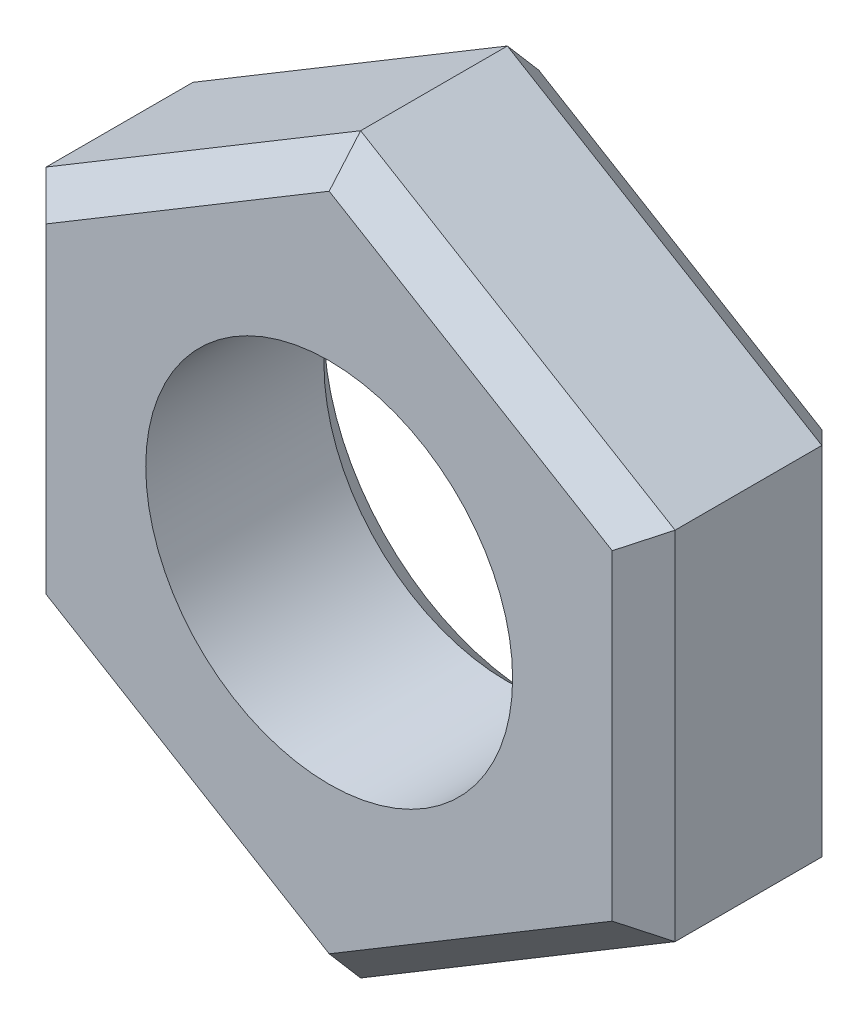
ISO-10303-21;
HEADER;
FILE_DESCRIPTION(('STEP AP214'),'2;1');
FILE_NAME('part.step','',(''),(''),'','','');
FILE_SCHEMA(('AUTOMOTIVE_DESIGN { 1 0 10303 214 1 1 1 1 }'));
ENDSEC;
DATA;
#1=APPLICATION_CONTEXT('core data for automotive mechanical design processes');
#2=APPLICATION_PROTOCOL_DEFINITION('international standard','automotive_design',2000,#1);
#3=PRODUCT_CONTEXT('',#1,'mechanical');
#4=PRODUCT('Part','Part','',(#3));
#5=PRODUCT_RELATED_PRODUCT_CATEGORY('part','',(#4));
#6=PRODUCT_DEFINITION_FORMATION('','',#4);
#7=PRODUCT_DEFINITION_CONTEXT('part definition',#1,'design');
#8=PRODUCT_DEFINITION('design','',#6,#7);
#9=PRODUCT_DEFINITION_SHAPE('','',#8);
#10=(LENGTH_UNIT() NAMED_UNIT(*) SI_UNIT(.MILLI.,.METRE.));
#11=(NAMED_UNIT(*) PLANE_ANGLE_UNIT() SI_UNIT($,.RADIAN.));
#12=(NAMED_UNIT(*) SI_UNIT($,.STERADIAN.) SOLID_ANGLE_UNIT());
#13=UNCERTAINTY_MEASURE_WITH_UNIT(LENGTH_MEASURE(1.E-05),#10,'distance_accuracy_value','');
#14=(GEOMETRIC_REPRESENTATION_CONTEXT(3) GLOBAL_UNCERTAINTY_ASSIGNED_CONTEXT((#13)) GLOBAL_UNIT_ASSIGNED_CONTEXT((#10,
#11,#12)) REPRESENTATION_CONTEXT('',''));
#15=CARTESIAN_POINT('',(0.,0.,0.));
#16=DIRECTION('',(0.,0.,1.));
#17=DIRECTION('',(1.,0.,0.));
#18=AXIS2_PLACEMENT_3D('',#15,#16,#17);
#19=CARTESIAN_POINT('',(29.1666666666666,0.,10.));
#20=DIRECTION('',(0.,0.,1.));
#21=DIRECTION('',(1.,0.,0.));
#22=AXIS2_PLACEMENT_3D('',#19,#20,#21);
#23=PLANE('',#22);
#24=DIRECTION('',(0.857492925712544,0.514495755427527,0.));
#25=VECTOR('',#24,1.);
#26=CARTESIAN_POINT('',(14.2282563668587,-7.21376061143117,10.));
#27=LINE('',#26,#25);
#28=CARTESIAN_POINT('',(0.,-15.7507144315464,10.));
#29=VERTEX_POINT('',#28);
#30=CARTESIAN_POINT('',(13.5,-7.6507144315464,10.));
#31=VERTEX_POINT('',#30);
#32=EDGE_CURVE('E147',#29,#31,#27,.T.);
#33=ORIENTED_EDGE('',*,*,#32,.T.);
#34=DIRECTION('',(0.,1.,0.));
#35=VECTOR('',#34,1.);
#36=CARTESIAN_POINT('',(13.5,8.49999999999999,10.));
#37=LINE('',#36,#35);
#38=CARTESIAN_POINT('',(13.5,7.65071443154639,10.));
#39=VERTEX_POINT('',#38);
#40=EDGE_CURVE('E128',#31,#39,#37,.T.);
#41=ORIENTED_EDGE('',*,*,#40,.T.);
#42=DIRECTION('',(-0.857492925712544,0.514495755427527,0.));
#43=VECTOR('',#42,1.);
#44=CARTESIAN_POINT('',(-0.771743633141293,16.2137606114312,10.));
#45=LINE('',#44,#43);
#46=CARTESIAN_POINT('',(0.,15.7507144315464,10.));
#47=VERTEX_POINT('',#46);
#48=EDGE_CURVE('E136',#39,#47,#45,.T.);
#49=ORIENTED_EDGE('',*,*,#48,.T.);
#50=DIRECTION('',(-0.857492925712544,-0.514495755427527,0.));
#51=VECTOR('',#50,1.);
#52=CARTESIAN_POINT('',(-14.2282563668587,7.21376061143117,10.));
#53=LINE('',#52,#51);
#54=CARTESIAN_POINT('',(-13.5,7.6507144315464,10.));
#55=VERTEX_POINT('',#54);
#56=EDGE_CURVE('E142',#47,#55,#53,.T.);
#57=ORIENTED_EDGE('',*,*,#56,.T.);
#58=DIRECTION('',(0.,-1.,0.));
#59=VECTOR('',#58,1.);
#60=CARTESIAN_POINT('',(-13.5,-8.5,10.));
#61=LINE('',#60,#59);
#62=CARTESIAN_POINT('',(-13.5,-7.6507144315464,10.));
#63=VERTEX_POINT('',#62);
#64=EDGE_CURVE('E252',#55,#63,#61,.T.);
#65=ORIENTED_EDGE('',*,*,#64,.T.);
#66=DIRECTION('',(0.857492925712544,-0.514495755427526,0.));
#67=VECTOR('',#66,1.);
#68=CARTESIAN_POINT('',(0.771743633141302,-16.2137606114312,10.));
#69=LINE('',#68,#67);
#70=EDGE_CURVE('E152',#63,#29,#69,.T.);
#71=ORIENTED_EDGE('',*,*,#70,.T.);
#72=EDGE_LOOP('',(#33,#41,#49,#57,#65,#71));
#73=FACE_BOUND('',#72,.T.);
#74=CARTESIAN_POINT('',(0.,0.,10.));
#75=DIRECTION('',(0.,0.,1.));
#76=DIRECTION('',(1.,0.,0.));
#77=AXIS2_PLACEMENT_3D('',#74,#75,#76);
#78=CIRCLE('',#77,8.75);
#79=CARTESIAN_POINT('',(8.75,0.,10.));
#80=VERTEX_POINT('',#79);
#81=EDGE_CURVE('E201',#80,#80,#78,.T.);
#82=ORIENTED_EDGE('',*,*,#81,.F.);
#83=EDGE_LOOP('',(#82));
#84=FACE_BOUND('',#83,.T.);
#85=ADVANCED_FACE('F32',(#73,#84),#23,.T.);
#86=CARTESIAN_POINT('',(29.1666666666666,0.,0.));
#87=DIRECTION('',(0.,0.,1.));
#88=DIRECTION('',(1.,0.,0.));
#89=AXIS2_PLACEMENT_3D('',#86,#87,#88);
#90=PLANE('',#89);
#91=CARTESIAN_POINT('',(0.,0.,0.));
#92=DIRECTION('',(0.,0.,1.));
#93=DIRECTION('',(1.,0.,0.));
#94=AXIS2_PLACEMENT_3D('',#91,#92,#93);
#95=CIRCLE('',#94,10.25);
#96=CARTESIAN_POINT('',(10.25,0.,0.));
#97=VERTEX_POINT('',#96);
#98=EDGE_CURVE('E41',#97,#97,#95,.T.);
#99=ORIENTED_EDGE('',*,*,#98,.T.);
#100=EDGE_LOOP('',(#99));
#101=FACE_BOUND('',#100,.T.);
#102=DIRECTION('',(0.,1.,0.));
#103=VECTOR('',#102,1.);
#104=CARTESIAN_POINT('',(-13.5,0.,0.));
#105=LINE('',#104,#103);
#106=CARTESIAN_POINT('',(-13.5,-7.65071443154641,0.));
#107=VERTEX_POINT('',#106);
#108=CARTESIAN_POINT('',(-13.5,7.65071443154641,0.));
#109=VERTEX_POINT('',#108);
#110=EDGE_CURVE('E49',#107,#109,#105,.T.);
#111=ORIENTED_EDGE('',*,*,#110,.T.);
#112=DIRECTION('',(0.857492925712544,0.514495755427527,0.));
#113=VECTOR('',#112,1.);
#114=CARTESIAN_POINT('',(14.4972338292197,24.4490547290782,0.));
#115=LINE('',#114,#113);
#116=CARTESIAN_POINT('',(0.,15.7507144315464,0.));
#117=VERTEX_POINT('',#116);
#118=EDGE_CURVE('E186',#109,#117,#115,.T.);
#119=ORIENTED_EDGE('',*,*,#118,.T.);
#120=DIRECTION('',(0.857492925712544,-0.514495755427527,0.));
#121=VECTOR('',#120,1.);
#122=CARTESIAN_POINT('',(28.3949230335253,-1.28623938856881,0.));
#123=LINE('',#122,#121);
#124=CARTESIAN_POINT('',(13.5,7.6507144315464,0.));
#125=VERTEX_POINT('',#124);
#126=EDGE_CURVE('E178',#117,#125,#123,.T.);
#127=ORIENTED_EDGE('',*,*,#126,.T.);
#128=DIRECTION('',(0.,-1.,0.));
#129=VECTOR('',#128,1.);
#130=CARTESIAN_POINT('',(13.5,0.,0.));
#131=LINE('',#130,#129);
#132=CARTESIAN_POINT('',(13.5,-7.6507144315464,0.));
#133=VERTEX_POINT('',#132);
#134=EDGE_CURVE('E180',#125,#133,#131,.T.);
#135=ORIENTED_EDGE('',*,*,#134,.T.);
#136=DIRECTION('',(-0.857492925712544,-0.514495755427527,0.));
#137=VECTOR('',#136,1.);
#138=CARTESIAN_POINT('',(28.3949230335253,1.28623938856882,0.));
#139=LINE('',#138,#137);
#140=CARTESIAN_POINT('',(0.,-15.7507144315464,0.));
#141=VERTEX_POINT('',#140);
#142=EDGE_CURVE('E182',#133,#141,#139,.T.);
#143=ORIENTED_EDGE('',*,*,#142,.T.);
#144=DIRECTION('',(-0.857492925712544,0.514495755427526,0.));
#145=VECTOR('',#144,1.);
#146=CARTESIAN_POINT('',(14.4972338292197,-24.4490547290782,0.));
#147=LINE('',#146,#145);
#148=EDGE_CURVE('E54',#141,#107,#147,.T.);
#149=ORIENTED_EDGE('',*,*,#148,.T.);
#150=EDGE_LOOP('',(#111,#119,#127,#135,#143,#149));
#151=FACE_BOUND('',#150,.T.);
#152=ADVANCED_FACE('F226',(#101,#151),#90,.F.);
#153=CARTESIAN_POINT('',(15.,8.49999999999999,10.));
#154=DIRECTION('',(-0.514495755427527,-0.857492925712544,0.));
#155=DIRECTION('',(0.857492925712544,-0.514495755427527,0.));
#156=AXIS2_PLACEMENT_3D('',#153,#154,#155);
#157=PLANE('',#156);
#158=DIRECTION('',(0.,0.,-1.));
#159=VECTOR('',#158,1.);
#160=CARTESIAN_POINT('',(0.,17.5,10.));
#161=LINE('',#160,#159);
#162=CARTESIAN_POINT('',(0.,17.5,8.49999999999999));
#163=VERTEX_POINT('',#162);
#164=CARTESIAN_POINT('',(0.,17.5,1.5));
#165=VERTEX_POINT('',#164);
#166=EDGE_CURVE('E143',#163,#165,#161,.T.);
#167=ORIENTED_EDGE('',*,*,#166,.F.);
#168=DIRECTION('',(0.857492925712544,-0.514495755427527,0.));
#169=VECTOR('',#168,1.);
#170=CARTESIAN_POINT('',(15.,8.49999999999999,8.49999999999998));
#171=LINE('',#170,#169);
#172=CARTESIAN_POINT('',(15.,8.49999999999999,8.49999999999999));
#173=VERTEX_POINT('',#172);
#174=EDGE_CURVE('E176',#163,#173,#171,.T.);
#175=ORIENTED_EDGE('',*,*,#174,.T.);
#176=DIRECTION('',(0.,0.,-1.));
#177=VECTOR('',#176,1.);
#178=CARTESIAN_POINT('',(15.,8.49999999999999,10.));
#179=LINE('',#178,#177);
#180=CARTESIAN_POINT('',(15.,8.49999999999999,1.5));
#181=VERTEX_POINT('',#180);
#182=EDGE_CURVE('E239',#173,#181,#179,.T.);
#183=ORIENTED_EDGE('',*,*,#182,.T.);
#184=DIRECTION('',(-0.857492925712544,0.514495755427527,0.));
#185=VECTOR('',#184,1.);
#186=CARTESIAN_POINT('',(15.,8.49999999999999,1.5));
#187=LINE('',#186,#185);
#188=EDGE_CURVE('E174',#181,#165,#187,.T.);
#189=ORIENTED_EDGE('',*,*,#188,.T.);
#190=EDGE_LOOP('',(#167,#175,#183,#189));
#191=FACE_BOUND('',#190,.T.);
#192=ADVANCED_FACE('F237',(#191),#157,.F.);
#193=CARTESIAN_POINT('',(-15.,8.5,10.));
#194=DIRECTION('',(0.514495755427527,-0.857492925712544,0.));
#195=DIRECTION('',(0.857492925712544,0.514495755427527,0.));
#196=AXIS2_PLACEMENT_3D('',#193,#194,#195);
#197=PLANE('',#196);
#198=DIRECTION('',(0.,0.,-1.));
#199=VECTOR('',#198,1.);
#200=CARTESIAN_POINT('',(-15.,8.5,10.));
#201=LINE('',#200,#199);
#202=CARTESIAN_POINT('',(-15.,8.5,8.49999999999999));
#203=VERTEX_POINT('',#202);
#204=CARTESIAN_POINT('',(-15.,8.5,1.5));
#205=VERTEX_POINT('',#204);
#206=EDGE_CURVE('E245',#203,#205,#201,.T.);
#207=ORIENTED_EDGE('',*,*,#206,.F.);
#208=DIRECTION('',(0.857492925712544,0.514495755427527,0.));
#209=VECTOR('',#208,1.);
#210=CARTESIAN_POINT('',(0.,17.5,8.49999999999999));
#211=LINE('',#210,#209);
#212=EDGE_CURVE('E172',#203,#163,#211,.T.);
#213=ORIENTED_EDGE('',*,*,#212,.T.);
#214=ORIENTED_EDGE('',*,*,#166,.T.);
#215=DIRECTION('',(-0.857492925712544,-0.514495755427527,0.));
#216=VECTOR('',#215,1.);
#217=CARTESIAN_POINT('',(-15.,8.5,1.5));
#218=LINE('',#217,#216);
#219=EDGE_CURVE('E169',#165,#205,#218,.T.);
#220=ORIENTED_EDGE('',*,*,#219,.T.);
#221=EDGE_LOOP('',(#207,#213,#214,#220));
#222=FACE_BOUND('',#221,.T.);
#223=ADVANCED_FACE('F242',(#222),#197,.F.);
#224=CARTESIAN_POINT('',(-15.,-8.5,10.));
#225=DIRECTION('',(1.,0.,0.));
#226=DIRECTION('',(0.,1.,0.));
#227=AXIS2_PLACEMENT_3D('',#224,#225,#226);
#228=PLANE('',#227);
#229=DIRECTION('',(0.,0.,-1.));
#230=VECTOR('',#229,1.);
#231=CARTESIAN_POINT('',(-15.,-8.5,10.));
#232=LINE('',#231,#230);
#233=CARTESIAN_POINT('',(-15.,-8.5,8.49999999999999));
#234=VERTEX_POINT('',#233);
#235=CARTESIAN_POINT('',(-15.,-8.5,1.5));
#236=VERTEX_POINT('',#235);
#237=EDGE_CURVE('E247',#234,#236,#232,.T.);
#238=ORIENTED_EDGE('',*,*,#237,.F.);
#239=DIRECTION('',(0.,1.,0.));
#240=VECTOR('',#239,1.);
#241=CARTESIAN_POINT('',(-15.,8.5,8.49999999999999));
#242=LINE('',#241,#240);
#243=EDGE_CURVE('E167',#234,#203,#242,.T.);
#244=ORIENTED_EDGE('',*,*,#243,.T.);
#245=ORIENTED_EDGE('',*,*,#206,.T.);
#246=DIRECTION('',(0.,-1.,0.));
#247=VECTOR('',#246,1.);
#248=CARTESIAN_POINT('',(-15.,-8.5,1.5));
#249=LINE('',#248,#247);
#250=EDGE_CURVE('E165',#205,#236,#249,.T.);
#251=ORIENTED_EDGE('',*,*,#250,.T.);
#252=EDGE_LOOP('',(#238,#244,#245,#251));
#253=FACE_BOUND('',#252,.T.);
#254=ADVANCED_FACE('F313',(#253),#228,.F.);
#255=CARTESIAN_POINT('',(-15.,-8.5,10.));
#256=DIRECTION('',(0.514495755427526,0.857492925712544,0.));
#257=DIRECTION('',(-0.857492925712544,0.514495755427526,0.));
#258=AXIS2_PLACEMENT_3D('',#255,#256,#257);
#259=PLANE('',#258);
#260=DIRECTION('',(0.,0.,-1.));
#261=VECTOR('',#260,1.);
#262=CARTESIAN_POINT('',(0.,-17.5,10.));
#263=LINE('',#262,#261);
#264=CARTESIAN_POINT('',(0.,-17.5,8.49999999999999));
#265=VERTEX_POINT('',#264);
#266=CARTESIAN_POINT('',(0.,-17.5,1.5));
#267=VERTEX_POINT('',#266);
#268=EDGE_CURVE('E272',#265,#267,#263,.T.);
#269=ORIENTED_EDGE('',*,*,#268,.F.);
#270=DIRECTION('',(-0.857492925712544,0.514495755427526,0.));
#271=VECTOR('',#270,1.);
#272=CARTESIAN_POINT('',(-15.,-8.5,8.49999999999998));
#273=LINE('',#272,#271);
#274=EDGE_CURVE('E163',#265,#234,#273,.T.);
#275=ORIENTED_EDGE('',*,*,#274,.T.);
#276=ORIENTED_EDGE('',*,*,#237,.T.);
#277=DIRECTION('',(0.857492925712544,-0.514495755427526,0.));
#278=VECTOR('',#277,1.);
#279=CARTESIAN_POINT('',(-15.,-8.5,1.5));
#280=LINE('',#279,#278);
#281=EDGE_CURVE('E161',#236,#267,#280,.T.);
#282=ORIENTED_EDGE('',*,*,#281,.T.);
#283=EDGE_LOOP('',(#269,#275,#276,#282));
#284=FACE_BOUND('',#283,.T.);
#285=ADVANCED_FACE('F280',(#284),#259,.F.);
#286=CARTESIAN_POINT('',(15.,-8.49999999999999,10.));
#287=DIRECTION('',(-0.514495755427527,0.857492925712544,0.));
#288=DIRECTION('',(-0.857492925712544,-0.514495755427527,0.));
#289=AXIS2_PLACEMENT_3D('',#286,#287,#288);
#290=PLANE('',#289);
#291=DIRECTION('',(0.,0.,-1.));
#292=VECTOR('',#291,1.);
#293=CARTESIAN_POINT('',(15.,-8.49999999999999,10.));
#294=LINE('',#293,#292);
#295=CARTESIAN_POINT('',(15.,-8.49999999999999,8.49999999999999));
#296=VERTEX_POINT('',#295);
#297=CARTESIAN_POINT('',(15.,-8.49999999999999,1.5));
#298=VERTEX_POINT('',#297);
#299=EDGE_CURVE('E270',#296,#298,#294,.T.);
#300=ORIENTED_EDGE('',*,*,#299,.F.);
#301=DIRECTION('',(-0.857492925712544,-0.514495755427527,0.));
#302=VECTOR('',#301,1.);
#303=CARTESIAN_POINT('',(0.,-17.5,8.49999999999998));
#304=LINE('',#303,#302);
#305=EDGE_CURVE('E159',#296,#265,#304,.T.);
#306=ORIENTED_EDGE('',*,*,#305,.T.);
#307=ORIENTED_EDGE('',*,*,#268,.T.);
#308=DIRECTION('',(0.857492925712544,0.514495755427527,0.));
#309=VECTOR('',#308,1.);
#310=CARTESIAN_POINT('',(15.,-8.49999999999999,1.5));
#311=LINE('',#310,#309);
#312=EDGE_CURVE('E157',#267,#298,#311,.T.);
#313=ORIENTED_EDGE('',*,*,#312,.T.);
#314=EDGE_LOOP('',(#300,#306,#307,#313));
#315=FACE_BOUND('',#314,.T.);
#316=ADVANCED_FACE('F271',(#315),#290,.F.);
#317=CARTESIAN_POINT('',(15.,-8.49999999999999,10.));
#318=DIRECTION('',(-1.,0.,0.));
#319=DIRECTION('',(0.,-1.,0.));
#320=AXIS2_PLACEMENT_3D('',#317,#318,#319);
#321=PLANE('',#320);
#322=ORIENTED_EDGE('',*,*,#182,.F.);
#323=DIRECTION('',(0.,-1.,0.));
#324=VECTOR('',#323,1.);
#325=CARTESIAN_POINT('',(15.,-8.49999999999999,8.49999999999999));
#326=LINE('',#325,#324);
#327=EDGE_CURVE('E130',#173,#296,#326,.T.);
#328=ORIENTED_EDGE('',*,*,#327,.T.);
#329=ORIENTED_EDGE('',*,*,#299,.T.);
#330=DIRECTION('',(0.,1.,0.));
#331=VECTOR('',#330,1.);
#332=CARTESIAN_POINT('',(15.,-8.49999999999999,1.5));
#333=LINE('',#332,#331);
#334=EDGE_CURVE('E149',#298,#181,#333,.T.);
#335=ORIENTED_EDGE('',*,*,#334,.T.);
#336=EDGE_LOOP('',(#322,#328,#329,#335));
#337=FACE_BOUND('',#336,.T.);
#338=ADVANCED_FACE('F269',(#337),#321,.F.);
#339=CARTESIAN_POINT('',(0.,0.,10.));
#340=DIRECTION('',(0.,0.,-1.));
#341=DIRECTION('',(-1.,0.,0.));
#342=AXIS2_PLACEMENT_3D('',#339,#340,#341);
#343=CYLINDRICAL_SURFACE('',#342,8.75);
#344=CARTESIAN_POINT('',(0.,0.,1.50000000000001));
#345=DIRECTION('',(0.,0.,1.));
#346=DIRECTION('',(1.,0.,0.));
#347=AXIS2_PLACEMENT_3D('',#344,#345,#346);
#348=CIRCLE('',#347,8.75);
#349=CARTESIAN_POINT('',(8.75,0.,1.50000000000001));
#350=VERTEX_POINT('',#349);
#351=EDGE_CURVE('E11',#350,#350,#348,.F.);
#352=ORIENTED_EDGE('',*,*,#351,.T.);
#353=EDGE_LOOP('',(#352));
#354=FACE_BOUND('',#353,.T.);
#355=ORIENTED_EDGE('',*,*,#81,.T.);
#356=EDGE_LOOP('',(#355));
#357=FACE_BOUND('',#356,.T.);
#358=ADVANCED_FACE('F305',(#354,#357),#343,.F.);
#359=CARTESIAN_POINT('',(-13.5,0.,10.));
#360=DIRECTION('',(-0.707106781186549,0.,0.707106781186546));
#361=DIRECTION('',(0.707106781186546,0.,0.707106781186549));
#362=AXIS2_PLACEMENT_3D('',#359,#360,#361);
#363=PLANE('',#362);
#364=DIRECTION('',(0.656451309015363,-0.371676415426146,0.656451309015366));
#365=VECTOR('',#364,1.);
#366=CARTESIAN_POINT('',(-5.53378357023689,3.14031933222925,17.9662164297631));
#367=LINE('',#366,#365);
#368=EDGE_CURVE('E195',#203,#55,#367,.T.);
#369=ORIENTED_EDGE('',*,*,#368,.F.);
#370=ORIENTED_EDGE('',*,*,#243,.F.);
#371=DIRECTION('',(0.656451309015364,0.371676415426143,0.656451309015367));
#372=VECTOR('',#371,1.);
#373=CARTESIAN_POINT('',(-11.6333215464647,-6.59381905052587,11.8666784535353));
#374=LINE('',#373,#372);
#375=EDGE_CURVE('E198',#63,#234,#374,.F.);
#376=ORIENTED_EDGE('',*,*,#375,.F.);
#377=ORIENTED_EDGE('',*,*,#64,.F.);
#378=EDGE_LOOP('',(#369,#370,#376,#377));
#379=FACE_BOUND('',#378,.T.);
#380=ADVANCED_FACE('F333',(#379),#363,.T.);
#381=CARTESIAN_POINT('',(14.4972338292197,-24.4490547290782,10.));
#382=DIRECTION('',(-0.3638034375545,-0.606339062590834,0.707106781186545));
#383=DIRECTION('',(0.,-0.759125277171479,-0.650944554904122));
#384=AXIS2_PLACEMENT_3D('',#381,#382,#383);
#385=PLANE('',#384);
#386=ORIENTED_EDGE('',*,*,#375,.T.);
#387=ORIENTED_EDGE('',*,*,#274,.F.);
#388=DIRECTION('',(0.,0.759125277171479,0.650944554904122));
#389=VECTOR('',#388,1.);
#390=CARTESIAN_POINT('',(0.,-20.7633173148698,5.70172848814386));
#391=LINE('',#390,#389);
#392=EDGE_CURVE('E192',#29,#265,#391,.F.);
#393=ORIENTED_EDGE('',*,*,#392,.F.);
#394=ORIENTED_EDGE('',*,*,#70,.F.);
#395=EDGE_LOOP('',(#386,#387,#393,#394));
#396=FACE_BOUND('',#395,.T.);
#397=ADVANCED_FACE('F259',(#396),#385,.T.);
#398=CARTESIAN_POINT('',(14.4972338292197,24.4490547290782,10.));
#399=DIRECTION('',(-0.3638034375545,0.606339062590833,0.707106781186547));
#400=DIRECTION('',(0.,-0.759125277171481,0.65094455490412));
#401=AXIS2_PLACEMENT_3D('',#398,#399,#400);
#402=PLANE('',#401);
#403=ORIENTED_EDGE('',*,*,#368,.T.);
#404=ORIENTED_EDGE('',*,*,#56,.F.);
#405=DIRECTION('',(0.,-0.75912527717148,0.650944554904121));
#406=VECTOR('',#405,1.);
#407=CARTESIAN_POINT('',(0.,5.93280884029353,18.418784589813));
#408=LINE('',#407,#406);
#409=EDGE_CURVE('E139',#163,#47,#408,.T.);
#410=ORIENTED_EDGE('',*,*,#409,.F.);
#411=ORIENTED_EDGE('',*,*,#212,.F.);
#412=EDGE_LOOP('',(#403,#404,#410,#411));
#413=FACE_BOUND('',#412,.T.);
#414=ADVANCED_FACE('F327',(#413),#402,.T.);
#415=CARTESIAN_POINT('',(28.3949230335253,1.28623938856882,10.));
#416=DIRECTION('',(0.363803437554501,-0.606339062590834,0.707106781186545));
#417=DIRECTION('',(0.,-0.759125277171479,-0.650944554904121));
#418=AXIS2_PLACEMENT_3D('',#415,#416,#417);
#419=PLANE('',#418);
#420=ORIENTED_EDGE('',*,*,#392,.T.);
#421=ORIENTED_EDGE('',*,*,#305,.F.);
#422=DIRECTION('',(-0.656451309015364,0.371676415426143,0.656451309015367));
#423=VECTOR('',#422,1.);
#424=CARTESIAN_POINT('',(17.7381394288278,-10.0503082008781,5.76186057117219));
#425=LINE('',#424,#423);
#426=EDGE_CURVE('E133',#31,#296,#425,.F.);
#427=ORIENTED_EDGE('',*,*,#426,.F.);
#428=ORIENTED_EDGE('',*,*,#32,.F.);
#429=EDGE_LOOP('',(#420,#421,#427,#428));
#430=FACE_BOUND('',#429,.T.);
#431=ADVANCED_FACE('F262',(#430),#419,.T.);
#432=CARTESIAN_POINT('',(28.3949230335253,-1.28623938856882,10.));
#433=DIRECTION('',(0.363803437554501,0.606339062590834,0.707106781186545));
#434=DIRECTION('',(0.,-0.759125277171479,0.650944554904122));
#435=AXIS2_PLACEMENT_3D('',#432,#433,#434);
#436=PLANE('',#435);
#437=ORIENTED_EDGE('',*,*,#409,.T.);
#438=ORIENTED_EDGE('',*,*,#48,.F.);
#439=DIRECTION('',(0.656451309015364,0.371676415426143,-0.656451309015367));
#440=VECTOR('',#439,1.);
#441=CARTESIAN_POINT('',(17.7381394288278,10.0503082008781,5.76186057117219));
#442=LINE('',#441,#440);
#443=EDGE_CURVE('E124',#173,#39,#442,.F.);
#444=ORIENTED_EDGE('',*,*,#443,.F.);
#445=ORIENTED_EDGE('',*,*,#174,.F.);
#446=EDGE_LOOP('',(#437,#438,#444,#445));
#447=FACE_BOUND('',#446,.T.);
#448=ADVANCED_FACE('F137',(#447),#436,.T.);
#449=CARTESIAN_POINT('',(13.5,0.,10.));
#450=DIRECTION('',(0.707106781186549,0.,0.707106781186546));
#451=DIRECTION('',(0.707106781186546,0.,-0.707106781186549));
#452=AXIS2_PLACEMENT_3D('',#449,#450,#451);
#453=PLANE('',#452);
#454=ORIENTED_EDGE('',*,*,#426,.T.);
#455=ORIENTED_EDGE('',*,*,#327,.F.);
#456=ORIENTED_EDGE('',*,*,#443,.T.);
#457=ORIENTED_EDGE('',*,*,#40,.F.);
#458=EDGE_LOOP('',(#454,#455,#456,#457));
#459=FACE_BOUND('',#458,.T.);
#460=ADVANCED_FACE('F126',(#459),#453,.T.);
#461=CARTESIAN_POINT('',(0.,0.,0.));
#462=DIRECTION('',(0.,0.,-1.));
#463=DIRECTION('',(-1.,0.,0.));
#464=AXIS2_PLACEMENT_3D('',#461,#462,#463);
#465=CONICAL_SURFACE('',#464,10.25,0.785398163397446);
#466=ORIENTED_EDGE('',*,*,#351,.F.);
#467=EDGE_LOOP('',(#466));
#468=FACE_BOUND('',#467,.T.);
#469=ORIENTED_EDGE('',*,*,#98,.F.);
#470=EDGE_LOOP('',(#469));
#471=FACE_BOUND('',#470,.T.);
#472=ADVANCED_FACE('F322',(#468,#471),#465,.F.);
#473=CARTESIAN_POINT('',(15.,-8.49999999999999,1.5));
#474=DIRECTION('',(-0.3638034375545,0.606339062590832,0.707106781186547));
#475=DIRECTION('',(0.,-0.759125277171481,0.650944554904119));
#476=AXIS2_PLACEMENT_3D('',#473,#474,#475);
#477=PLANE('',#476);
#478=DIRECTION('',(0.,0.759125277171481,-0.650944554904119));
#479=VECTOR('',#478,1.);
#480=CARTESIAN_POINT('',(0.,-12.3135593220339,-2.94733619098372));
#481=LINE('',#480,#479);
#482=EDGE_CURVE('E211',#141,#267,#481,.F.);
#483=ORIENTED_EDGE('',*,*,#482,.F.);
#484=ORIENTED_EDGE('',*,*,#142,.F.);
#485=DIRECTION('',(-0.656451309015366,0.371676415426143,-0.656451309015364));
#486=VECTOR('',#485,1.);
#487=CARTESIAN_POINT('',(15.,-8.49999999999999,1.5));
#488=LINE('',#487,#486);
#489=EDGE_CURVE('E36',#298,#133,#488,.T.);
#490=ORIENTED_EDGE('',*,*,#489,.F.);
#491=ORIENTED_EDGE('',*,*,#312,.F.);
#492=EDGE_LOOP('',(#483,#484,#490,#491));
#493=FACE_BOUND('',#492,.T.);
#494=ADVANCED_FACE('F34',(#493),#477,.F.);
#495=CARTESIAN_POINT('',(15.,-8.49999999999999,1.5));
#496=DIRECTION('',(-0.707106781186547,0.,0.707106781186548));
#497=DIRECTION('',(0.707106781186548,0.,0.707106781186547));
#498=AXIS2_PLACEMENT_3D('',#495,#496,#497);
#499=PLANE('',#498);
#500=ORIENTED_EDGE('',*,*,#489,.T.);
#501=ORIENTED_EDGE('',*,*,#134,.F.);
#502=DIRECTION('',(-0.656451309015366,-0.371676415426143,-0.656451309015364));
#503=VECTOR('',#502,1.);
#504=CARTESIAN_POINT('',(15.,8.49999999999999,1.5));
#505=LINE('',#504,#503);
#506=EDGE_CURVE('E209',#181,#125,#505,.T.);
#507=ORIENTED_EDGE('',*,*,#506,.F.);
#508=ORIENTED_EDGE('',*,*,#334,.F.);
#509=EDGE_LOOP('',(#500,#501,#507,#508));
#510=FACE_BOUND('',#509,.T.);
#511=ADVANCED_FACE('F221',(#510),#499,.F.);
#512=CARTESIAN_POINT('',(-15.,-8.5,1.5));
#513=DIRECTION('',(0.363803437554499,0.606339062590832,0.707106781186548));
#514=DIRECTION('',(0.,-0.759125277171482,0.650944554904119));
#515=AXIS2_PLACEMENT_3D('',#512,#513,#514);
#516=PLANE('',#515);
#517=ORIENTED_EDGE('',*,*,#482,.T.);
#518=ORIENTED_EDGE('',*,*,#281,.F.);
#519=DIRECTION('',(0.656451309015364,0.371676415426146,-0.656451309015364));
#520=VECTOR('',#519,1.);
#521=CARTESIAN_POINT('',(-15.,-8.5,1.5));
#522=LINE('',#521,#520);
#523=EDGE_CURVE('E206',#107,#236,#522,.F.);
#524=ORIENTED_EDGE('',*,*,#523,.F.);
#525=ORIENTED_EDGE('',*,*,#148,.F.);
#526=EDGE_LOOP('',(#517,#518,#524,#525));
#527=FACE_BOUND('',#526,.T.);
#528=ADVANCED_FACE('F283',(#527),#516,.F.);
#529=CARTESIAN_POINT('',(15.,8.49999999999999,1.5));
#530=DIRECTION('',(-0.3638034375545,-0.606339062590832,0.707106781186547));
#531=DIRECTION('',(0.,-0.759125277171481,-0.650944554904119));
#532=AXIS2_PLACEMENT_3D('',#529,#530,#531);
#533=PLANE('',#532);
#534=ORIENTED_EDGE('',*,*,#506,.T.);
#535=ORIENTED_EDGE('',*,*,#126,.F.);
#536=DIRECTION('',(0.,0.759125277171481,0.65094455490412));
#537=VECTOR('',#536,1.);
#538=CARTESIAN_POINT('',(0.,12.3135593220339,-2.9473361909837));
#539=LINE('',#538,#537);
#540=EDGE_CURVE('E204',#165,#117,#539,.F.);
#541=ORIENTED_EDGE('',*,*,#540,.F.);
#542=ORIENTED_EDGE('',*,*,#188,.F.);
#543=EDGE_LOOP('',(#534,#535,#541,#542));
#544=FACE_BOUND('',#543,.T.);
#545=ADVANCED_FACE('F230',(#544),#533,.F.);
#546=CARTESIAN_POINT('',(-15.,-8.5,1.5));
#547=DIRECTION('',(0.707106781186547,0.,0.707106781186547));
#548=DIRECTION('',(0.707106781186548,0.,-0.707106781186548));
#549=AXIS2_PLACEMENT_3D('',#546,#547,#548);
#550=PLANE('',#549);
#551=ORIENTED_EDGE('',*,*,#523,.T.);
#552=ORIENTED_EDGE('',*,*,#250,.F.);
#553=DIRECTION('',(0.656451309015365,-0.371676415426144,-0.656451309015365));
#554=VECTOR('',#553,1.);
#555=CARTESIAN_POINT('',(-10.8522130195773,6.15156291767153,-2.64778698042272));
#556=LINE('',#555,#554);
#557=EDGE_CURVE('E202',#109,#205,#556,.F.);
#558=ORIENTED_EDGE('',*,*,#557,.F.);
#559=ORIENTED_EDGE('',*,*,#110,.F.);
#560=EDGE_LOOP('',(#551,#552,#558,#559));
#561=FACE_BOUND('',#560,.T.);
#562=ADVANCED_FACE('F286',(#561),#550,.F.);
#563=CARTESIAN_POINT('',(-15.,8.5,1.5));
#564=DIRECTION('',(0.3638034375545,-0.606339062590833,0.707106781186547));
#565=DIRECTION('',(0.,-0.759125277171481,-0.65094455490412));
#566=AXIS2_PLACEMENT_3D('',#563,#564,#565);
#567=PLANE('',#566);
#568=ORIENTED_EDGE('',*,*,#540,.T.);
#569=ORIENTED_EDGE('',*,*,#118,.F.);
#570=ORIENTED_EDGE('',*,*,#557,.T.);
#571=ORIENTED_EDGE('',*,*,#219,.F.);
#572=EDGE_LOOP('',(#568,#569,#570,#571));
#573=FACE_BOUND('',#572,.T.);
#574=ADVANCED_FACE('F289',(#573),#567,.F.);
#575=CLOSED_SHELL('',(#85,#152,#192,#223,#254,#285,#316,#338,#358,#380,#397,#414,#431,#448,#460,
#472,#494,#511,#528,#545,#562,#574));
#576=MANIFOLD_SOLID_BREP('B2',#575);
#577=ADVANCED_BREP_SHAPE_REPRESENTATION('',(#18,#576),#14);
#578=SHAPE_DEFINITION_REPRESENTATION(#9,#577);
ENDSEC;
END-ISO-10303-21;
